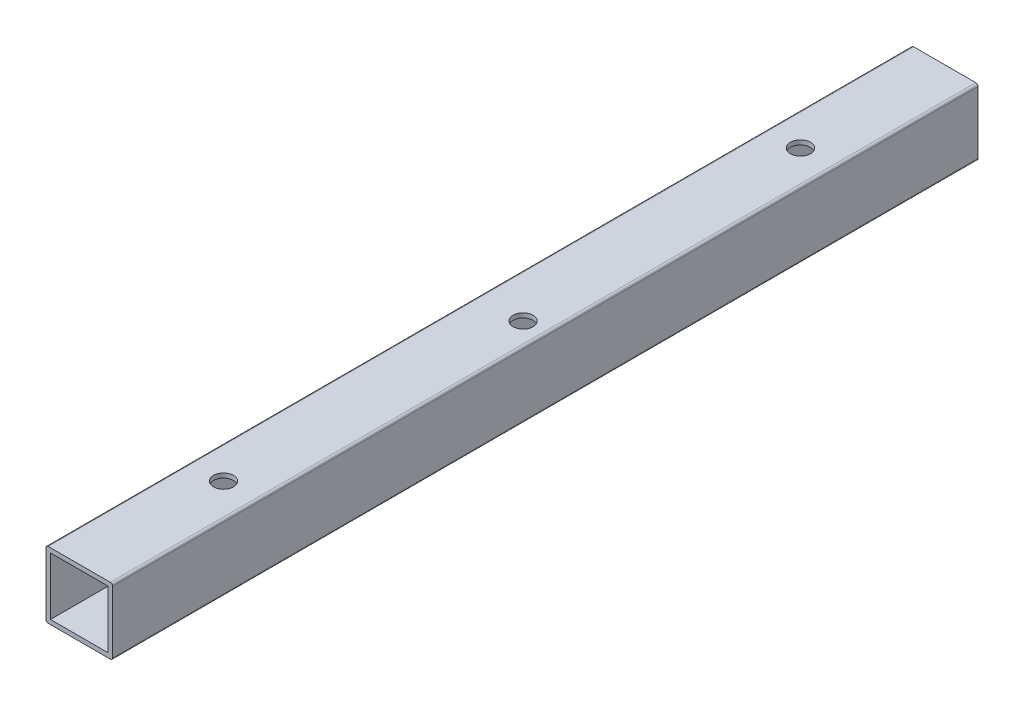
ISO-10303-21;
HEADER;
FILE_DESCRIPTION(('STEP AP214'),'2;1');
FILE_NAME('part.step','',(''),(''),'','','');
FILE_SCHEMA(('AUTOMOTIVE_DESIGN { 1 0 10303 214 1 1 1 1 }'));
ENDSEC;
DATA;
#1=APPLICATION_CONTEXT('core data for automotive mechanical design processes');
#2=APPLICATION_PROTOCOL_DEFINITION('international standard','automotive_design',2000,#1);
#3=PRODUCT_CONTEXT('',#1,'mechanical');
#4=PRODUCT('Part','Part','',(#3));
#5=PRODUCT_RELATED_PRODUCT_CATEGORY('part','',(#4));
#6=PRODUCT_DEFINITION_FORMATION('','',#4);
#7=PRODUCT_DEFINITION_CONTEXT('part definition',#1,'design');
#8=PRODUCT_DEFINITION('design','',#6,#7);
#9=PRODUCT_DEFINITION_SHAPE('','',#8);
#10=(LENGTH_UNIT() NAMED_UNIT(*) SI_UNIT(.MILLI.,.METRE.));
#11=(NAMED_UNIT(*) PLANE_ANGLE_UNIT() SI_UNIT($,.RADIAN.));
#12=(NAMED_UNIT(*) SI_UNIT($,.STERADIAN.) SOLID_ANGLE_UNIT());
#13=UNCERTAINTY_MEASURE_WITH_UNIT(LENGTH_MEASURE(1.E-05),#10,'distance_accuracy_value','');
#14=(GEOMETRIC_REPRESENTATION_CONTEXT(3) GLOBAL_UNCERTAINTY_ASSIGNED_CONTEXT((#13)) GLOBAL_UNIT_ASSIGNED_CONTEXT((#10,
#11,#12)) REPRESENTATION_CONTEXT('',''));
#15=CARTESIAN_POINT('',(0.,0.,0.));
#16=DIRECTION('',(0.,0.,1.));
#17=DIRECTION('',(1.,0.,0.));
#18=AXIS2_PLACEMENT_3D('',#15,#16,#17);
#19=CARTESIAN_POINT('',(-14.,-14.,0.));
#20=DIRECTION('',(0.,0.,-1.));
#21=DIRECTION('',(-1.,0.,0.));
#22=AXIS2_PLACEMENT_3D('',#19,#20,#21);
#23=PLANE('',#22);
#24=CARTESIAN_POINT('',(-14.,-14.,0.));
#25=DIRECTION('',(0.,0.,-1.));
#26=DIRECTION('',(-1.,0.,0.));
#27=AXIS2_PLACEMENT_3D('',#24,#25,#26);
#28=CIRCLE('',#27,0.999999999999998);
#29=CARTESIAN_POINT('',(-14.,-15.,0.));
#30=VERTEX_POINT('',#29);
#31=CARTESIAN_POINT('',(-15.,-14.,0.));
#32=VERTEX_POINT('',#31);
#33=EDGE_CURVE('E127',#30,#32,#28,.T.);
#34=ORIENTED_EDGE('',*,*,#33,.T.);
#35=DIRECTION('',(0.,-1.,0.));
#36=VECTOR('',#35,1.);
#37=CARTESIAN_POINT('',(-15.,14.,0.));
#38=LINE('',#37,#36);
#39=CARTESIAN_POINT('',(-15.,14.,0.));
#40=VERTEX_POINT('',#39);
#41=EDGE_CURVE('E163',#40,#32,#38,.T.);
#42=ORIENTED_EDGE('',*,*,#41,.F.);
#43=CARTESIAN_POINT('',(-14.,14.,0.));
#44=DIRECTION('',(0.,0.,-1.));
#45=DIRECTION('',(-1.,0.,0.));
#46=AXIS2_PLACEMENT_3D('',#43,#44,#45);
#47=CIRCLE('',#46,0.999999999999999);
#48=CARTESIAN_POINT('',(-14.,15.,0.));
#49=VERTEX_POINT('',#48);
#50=EDGE_CURVE('E166',#40,#49,#47,.T.);
#51=ORIENTED_EDGE('',*,*,#50,.T.);
#52=DIRECTION('',(1.,0.,0.));
#53=VECTOR('',#52,1.);
#54=CARTESIAN_POINT('',(-14.,15.,0.));
#55=LINE('',#54,#53);
#56=CARTESIAN_POINT('',(14.,15.,0.));
#57=VERTEX_POINT('',#56);
#58=EDGE_CURVE('E169',#49,#57,#55,.T.);
#59=ORIENTED_EDGE('',*,*,#58,.T.);
#60=CARTESIAN_POINT('',(14.,14.,0.));
#61=DIRECTION('',(0.,0.,1.));
#62=DIRECTION('',(1.,0.,0.));
#63=AXIS2_PLACEMENT_3D('',#60,#61,#62);
#64=CIRCLE('',#63,0.999999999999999);
#65=CARTESIAN_POINT('',(15.,14.,0.));
#66=VERTEX_POINT('',#65);
#67=EDGE_CURVE('E172',#66,#57,#64,.T.);
#68=ORIENTED_EDGE('',*,*,#67,.F.);
#69=DIRECTION('',(0.,1.,0.));
#70=VECTOR('',#69,1.);
#71=CARTESIAN_POINT('',(15.,-14.,0.));
#72=LINE('',#71,#70);
#73=CARTESIAN_POINT('',(15.,-14.,0.));
#74=VERTEX_POINT('',#73);
#75=EDGE_CURVE('E175',#74,#66,#72,.T.);
#76=ORIENTED_EDGE('',*,*,#75,.F.);
#77=CARTESIAN_POINT('',(14.,-14.,0.));
#78=DIRECTION('',(0.,0.,-1.));
#79=DIRECTION('',(-1.,0.,0.));
#80=AXIS2_PLACEMENT_3D('',#77,#78,#79);
#81=CIRCLE('',#80,1.);
#82=CARTESIAN_POINT('',(14.,-15.,0.));
#83=VERTEX_POINT('',#82);
#84=EDGE_CURVE('E177',#74,#83,#81,.T.);
#85=ORIENTED_EDGE('',*,*,#84,.T.);
#86=DIRECTION('',(-1.,0.,0.));
#87=VECTOR('',#86,1.);
#88=CARTESIAN_POINT('',(14.,-15.,0.));
#89=LINE('',#88,#87);
#90=EDGE_CURVE('E180',#83,#30,#89,.T.);
#91=ORIENTED_EDGE('',*,*,#90,.T.);
#92=EDGE_LOOP('',(#34,#42,#51,#59,#68,#76,#85,#91));
#93=FACE_BOUND('',#92,.T.);
#94=DIRECTION('',(1.,0.,0.));
#95=VECTOR('',#94,1.);
#96=CARTESIAN_POINT('',(-14.,13.,0.));
#97=LINE('',#96,#95);
#98=CARTESIAN_POINT('',(-13.,13.,0.));
#99=VERTEX_POINT('',#98);
#100=CARTESIAN_POINT('',(13.,13.,0.));
#101=VERTEX_POINT('',#100);
#102=EDGE_CURVE('E139',#99,#101,#97,.T.);
#103=ORIENTED_EDGE('',*,*,#102,.F.);
#104=DIRECTION('',(0.,-1.,0.));
#105=VECTOR('',#104,1.);
#106=CARTESIAN_POINT('',(-13.,-14.,0.));
#107=LINE('',#106,#105);
#108=CARTESIAN_POINT('',(-13.,-13.,0.));
#109=VERTEX_POINT('',#108);
#110=EDGE_CURVE('E55',#99,#109,#107,.T.);
#111=ORIENTED_EDGE('',*,*,#110,.T.);
#112=DIRECTION('',(-1.,0.,0.));
#113=VECTOR('',#112,1.);
#114=CARTESIAN_POINT('',(-14.,-13.,0.));
#115=LINE('',#114,#113);
#116=CARTESIAN_POINT('',(13.,-13.,0.));
#117=VERTEX_POINT('',#116);
#118=EDGE_CURVE('E131',#117,#109,#115,.T.);
#119=ORIENTED_EDGE('',*,*,#118,.F.);
#120=DIRECTION('',(0.,1.,0.));
#121=VECTOR('',#120,1.);
#122=CARTESIAN_POINT('',(13.,-14.,0.));
#123=LINE('',#122,#121);
#124=EDGE_CURVE('E136',#117,#101,#123,.T.);
#125=ORIENTED_EDGE('',*,*,#124,.T.);
#126=EDGE_LOOP('',(#103,#111,#119,#125));
#127=FACE_BOUND('',#126,.T.);
#128=ADVANCED_FACE('F30',(#93,#127),#23,.T.);
#129=CARTESIAN_POINT('',(-14.,-14.,390.));
#130=DIRECTION('',(0.,0.,-1.));
#131=DIRECTION('',(-1.,0.,0.));
#132=AXIS2_PLACEMENT_3D('',#129,#130,#131);
#133=CYLINDRICAL_SURFACE('',#132,0.999999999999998);
#134=ORIENTED_EDGE('',*,*,#33,.F.);
#135=DIRECTION('',(0.,0.,-1.));
#136=VECTOR('',#135,1.);
#137=CARTESIAN_POINT('',(-14.,-15.,390.));
#138=LINE('',#137,#136);
#139=CARTESIAN_POINT('',(-14.,-15.,390.));
#140=VERTEX_POINT('',#139);
#141=EDGE_CURVE('E11',#140,#30,#138,.T.);
#142=ORIENTED_EDGE('',*,*,#141,.F.);
#143=CARTESIAN_POINT('',(-14.,-14.,390.));
#144=DIRECTION('',(0.,0.,-1.));
#145=DIRECTION('',(-1.,0.,0.));
#146=AXIS2_PLACEMENT_3D('',#143,#144,#145);
#147=CIRCLE('',#146,0.999999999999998);
#148=CARTESIAN_POINT('',(-15.,-14.,390.));
#149=VERTEX_POINT('',#148);
#150=EDGE_CURVE('E183',#140,#149,#147,.T.);
#151=ORIENTED_EDGE('',*,*,#150,.T.);
#152=DIRECTION('',(0.,0.,-1.));
#153=VECTOR('',#152,1.);
#154=CARTESIAN_POINT('',(-15.,-14.,390.));
#155=LINE('',#154,#153);
#156=EDGE_CURVE('E203',#149,#32,#155,.T.);
#157=ORIENTED_EDGE('',*,*,#156,.T.);
#158=EDGE_LOOP('',(#134,#142,#151,#157));
#159=FACE_BOUND('',#158,.T.);
#160=ADVANCED_FACE('F32',(#159),#133,.T.);
#161=CARTESIAN_POINT('',(14.,-15.,390.));
#162=DIRECTION('',(0.,-1.,0.));
#163=DIRECTION('',(1.,0.,0.));
#164=AXIS2_PLACEMENT_3D('',#161,#162,#163);
#165=PLANE('',#164);
#166=CARTESIAN_POINT('',(5.,-15.,195.));
#167=DIRECTION('',(0.,-1.,0.));
#168=DIRECTION('',(1.,0.,0.));
#169=AXIS2_PLACEMENT_3D('',#166,#167,#168);
#170=CIRCLE('',#169,4.5);
#171=CARTESIAN_POINT('',(9.50000000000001,-15.,195.));
#172=VERTEX_POINT('',#171);
#173=EDGE_CURVE('E407',#172,#172,#170,.T.);
#174=ORIENTED_EDGE('',*,*,#173,.F.);
#175=EDGE_LOOP('',(#174));
#176=FACE_BOUND('',#175,.T.);
#177=CARTESIAN_POINT('',(0.,-15.,65.));
#178=DIRECTION('',(0.,-1.,0.));
#179=DIRECTION('',(1.,0.,0.));
#180=AXIS2_PLACEMENT_3D('',#177,#178,#179);
#181=CIRCLE('',#180,4.5);
#182=CARTESIAN_POINT('',(4.5,-15.,65.));
#183=VERTEX_POINT('',#182);
#184=EDGE_CURVE('E224',#183,#183,#181,.T.);
#185=ORIENTED_EDGE('',*,*,#184,.F.);
#186=EDGE_LOOP('',(#185));
#187=FACE_BOUND('',#186,.T.);
#188=CARTESIAN_POINT('',(0.,-15.,325.));
#189=DIRECTION('',(0.,-1.,0.));
#190=DIRECTION('',(1.,0.,0.));
#191=AXIS2_PLACEMENT_3D('',#188,#189,#190);
#192=CIRCLE('',#191,4.5);
#193=CARTESIAN_POINT('',(4.5,-15.,325.));
#194=VERTEX_POINT('',#193);
#195=EDGE_CURVE('E220',#194,#194,#192,.T.);
#196=ORIENTED_EDGE('',*,*,#195,.F.);
#197=EDGE_LOOP('',(#196));
#198=FACE_BOUND('',#197,.T.);
#199=ORIENTED_EDGE('',*,*,#90,.F.);
#200=DIRECTION('',(0.,0.,-1.));
#201=VECTOR('',#200,1.);
#202=CARTESIAN_POINT('',(14.,-15.,390.));
#203=LINE('',#202,#201);
#204=CARTESIAN_POINT('',(14.,-15.,390.));
#205=VERTEX_POINT('',#204);
#206=EDGE_CURVE('E39',#205,#83,#203,.T.);
#207=ORIENTED_EDGE('',*,*,#206,.F.);
#208=DIRECTION('',(-1.,0.,0.));
#209=VECTOR('',#208,1.);
#210=CARTESIAN_POINT('',(14.,-15.,390.));
#211=LINE('',#210,#209);
#212=EDGE_CURVE('E201',#205,#140,#211,.T.);
#213=ORIENTED_EDGE('',*,*,#212,.T.);
#214=ORIENTED_EDGE('',*,*,#141,.T.);
#215=EDGE_LOOP('',(#199,#207,#213,#214));
#216=FACE_BOUND('',#215,.T.);
#217=ADVANCED_FACE('F269',(#176,#187,#198,#216),#165,.T.);
#218=CARTESIAN_POINT('',(14.,-14.,390.));
#219=DIRECTION('',(0.,0.,-1.));
#220=DIRECTION('',(-1.,0.,0.));
#221=AXIS2_PLACEMENT_3D('',#218,#219,#220);
#222=CYLINDRICAL_SURFACE('',#221,1.);
#223=ORIENTED_EDGE('',*,*,#84,.F.);
#224=DIRECTION('',(0.,0.,-1.));
#225=VECTOR('',#224,1.);
#226=CARTESIAN_POINT('',(15.,-14.,390.));
#227=LINE('',#226,#225);
#228=CARTESIAN_POINT('',(15.,-14.,390.));
#229=VERTEX_POINT('',#228);
#230=EDGE_CURVE('E206',#229,#74,#227,.T.);
#231=ORIENTED_EDGE('',*,*,#230,.F.);
#232=CARTESIAN_POINT('',(14.,-14.,390.));
#233=DIRECTION('',(0.,0.,-1.));
#234=DIRECTION('',(-1.,0.,0.));
#235=AXIS2_PLACEMENT_3D('',#232,#233,#234);
#236=CIRCLE('',#235,1.);
#237=EDGE_CURVE('E198',#229,#205,#236,.T.);
#238=ORIENTED_EDGE('',*,*,#237,.T.);
#239=ORIENTED_EDGE('',*,*,#206,.T.);
#240=EDGE_LOOP('',(#223,#231,#238,#239));
#241=FACE_BOUND('',#240,.T.);
#242=ADVANCED_FACE('F281',(#241),#222,.T.);
#243=CARTESIAN_POINT('',(15.,-14.,390.));
#244=DIRECTION('',(-1.,0.,0.));
#245=DIRECTION('',(0.,-1.,0.));
#246=AXIS2_PLACEMENT_3D('',#243,#244,#245);
#247=PLANE('',#246);
#248=ORIENTED_EDGE('',*,*,#75,.T.);
#249=DIRECTION('',(0.,0.,-1.));
#250=VECTOR('',#249,1.);
#251=CARTESIAN_POINT('',(15.,14.,390.));
#252=LINE('',#251,#250);
#253=CARTESIAN_POINT('',(15.,14.,390.));
#254=VERTEX_POINT('',#253);
#255=EDGE_CURVE('E208',#254,#66,#252,.T.);
#256=ORIENTED_EDGE('',*,*,#255,.F.);
#257=DIRECTION('',(0.,1.,0.));
#258=VECTOR('',#257,1.);
#259=CARTESIAN_POINT('',(15.,-14.,390.));
#260=LINE('',#259,#258);
#261=EDGE_CURVE('E196',#229,#254,#260,.T.);
#262=ORIENTED_EDGE('',*,*,#261,.F.);
#263=ORIENTED_EDGE('',*,*,#230,.T.);
#264=EDGE_LOOP('',(#248,#256,#262,#263));
#265=FACE_BOUND('',#264,.T.);
#266=ADVANCED_FACE('F285',(#265),#247,.F.);
#267=CARTESIAN_POINT('',(14.,14.,390.));
#268=DIRECTION('',(0.,0.,-1.));
#269=DIRECTION('',(-1.,0.,0.));
#270=AXIS2_PLACEMENT_3D('',#267,#268,#269);
#271=CYLINDRICAL_SURFACE('',#270,0.999999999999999);
#272=ORIENTED_EDGE('',*,*,#67,.T.);
#273=DIRECTION('',(0.,0.,-1.));
#274=VECTOR('',#273,1.);
#275=CARTESIAN_POINT('',(14.,15.,390.));
#276=LINE('',#275,#274);
#277=CARTESIAN_POINT('',(14.,15.,390.));
#278=VERTEX_POINT('',#277);
#279=EDGE_CURVE('E211',#278,#57,#276,.T.);
#280=ORIENTED_EDGE('',*,*,#279,.F.);
#281=CARTESIAN_POINT('',(14.,14.,390.));
#282=DIRECTION('',(0.,0.,1.));
#283=DIRECTION('',(1.,0.,0.));
#284=AXIS2_PLACEMENT_3D('',#281,#282,#283);
#285=CIRCLE('',#284,0.999999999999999);
#286=EDGE_CURVE('E194',#254,#278,#285,.T.);
#287=ORIENTED_EDGE('',*,*,#286,.F.);
#288=ORIENTED_EDGE('',*,*,#255,.T.);
#289=EDGE_LOOP('',(#272,#280,#287,#288));
#290=FACE_BOUND('',#289,.T.);
#291=ADVANCED_FACE('F289',(#290),#271,.T.);
#292=CARTESIAN_POINT('',(-14.,15.,390.));
#293=DIRECTION('',(0.,1.,0.));
#294=DIRECTION('',(0.,0.,1.));
#295=AXIS2_PLACEMENT_3D('',#292,#293,#294);
#296=PLANE('',#295);
#297=CARTESIAN_POINT('',(5.,15.,195.));
#298=DIRECTION('',(0.,1.,0.));
#299=DIRECTION('',(0.,0.,1.));
#300=AXIS2_PLACEMENT_3D('',#297,#298,#299);
#301=CIRCLE('',#300,4.5);
#302=CARTESIAN_POINT('',(5.,15.,199.5));
#303=VERTEX_POINT('',#302);
#304=EDGE_CURVE('E231',#303,#303,#301,.T.);
#305=ORIENTED_EDGE('',*,*,#304,.F.);
#306=EDGE_LOOP('',(#305));
#307=FACE_BOUND('',#306,.T.);
#308=CARTESIAN_POINT('',(0.,15.,65.));
#309=DIRECTION('',(0.,1.,0.));
#310=DIRECTION('',(0.,0.,1.));
#311=AXIS2_PLACEMENT_3D('',#308,#309,#310);
#312=CIRCLE('',#311,4.5);
#313=CARTESIAN_POINT('',(0.,15.,69.5));
#314=VERTEX_POINT('',#313);
#315=EDGE_CURVE('E228',#314,#314,#312,.T.);
#316=ORIENTED_EDGE('',*,*,#315,.F.);
#317=EDGE_LOOP('',(#316));
#318=FACE_BOUND('',#317,.T.);
#319=CARTESIAN_POINT('',(0.,15.,325.));
#320=DIRECTION('',(0.,1.,0.));
#321=DIRECTION('',(0.,0.,1.));
#322=AXIS2_PLACEMENT_3D('',#319,#320,#321);
#323=CIRCLE('',#322,4.5);
#324=CARTESIAN_POINT('',(0.,15.,329.5));
#325=VERTEX_POINT('',#324);
#326=EDGE_CURVE('E140',#325,#325,#323,.T.);
#327=ORIENTED_EDGE('',*,*,#326,.F.);
#328=EDGE_LOOP('',(#327));
#329=FACE_BOUND('',#328,.T.);
#330=ORIENTED_EDGE('',*,*,#58,.F.);
#331=DIRECTION('',(0.,0.,-1.));
#332=VECTOR('',#331,1.);
#333=CARTESIAN_POINT('',(-14.,15.,390.));
#334=LINE('',#333,#332);
#335=CARTESIAN_POINT('',(-14.,15.,390.));
#336=VERTEX_POINT('',#335);
#337=EDGE_CURVE('E213',#336,#49,#334,.T.);
#338=ORIENTED_EDGE('',*,*,#337,.F.);
#339=DIRECTION('',(1.,0.,0.));
#340=VECTOR('',#339,1.);
#341=CARTESIAN_POINT('',(-14.,15.,390.));
#342=LINE('',#341,#340);
#343=EDGE_CURVE('E191',#336,#278,#342,.T.);
#344=ORIENTED_EDGE('',*,*,#343,.T.);
#345=ORIENTED_EDGE('',*,*,#279,.T.);
#346=EDGE_LOOP('',(#330,#338,#344,#345));
#347=FACE_BOUND('',#346,.T.);
#348=ADVANCED_FACE('F293',(#307,#318,#329,#347),#296,.T.);
#349=CARTESIAN_POINT('',(-14.,14.,390.));
#350=DIRECTION('',(0.,0.,-1.));
#351=DIRECTION('',(-1.,0.,0.));
#352=AXIS2_PLACEMENT_3D('',#349,#350,#351);
#353=CYLINDRICAL_SURFACE('',#352,0.999999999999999);
#354=ORIENTED_EDGE('',*,*,#50,.F.);
#355=DIRECTION('',(0.,0.,-1.));
#356=VECTOR('',#355,1.);
#357=CARTESIAN_POINT('',(-15.,14.,390.));
#358=LINE('',#357,#356);
#359=CARTESIAN_POINT('',(-15.,14.,390.));
#360=VERTEX_POINT('',#359);
#361=EDGE_CURVE('E215',#360,#40,#358,.T.);
#362=ORIENTED_EDGE('',*,*,#361,.F.);
#363=CARTESIAN_POINT('',(-14.,14.,390.));
#364=DIRECTION('',(0.,0.,-1.));
#365=DIRECTION('',(-1.,0.,0.));
#366=AXIS2_PLACEMENT_3D('',#363,#364,#365);
#367=CIRCLE('',#366,0.999999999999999);
#368=EDGE_CURVE('E188',#360,#336,#367,.T.);
#369=ORIENTED_EDGE('',*,*,#368,.T.);
#370=ORIENTED_EDGE('',*,*,#337,.T.);
#371=EDGE_LOOP('',(#354,#362,#369,#370));
#372=FACE_BOUND('',#371,.T.);
#373=ADVANCED_FACE('F297',(#372),#353,.T.);
#374=CARTESIAN_POINT('',(-15.,14.,390.));
#375=DIRECTION('',(1.,0.,0.));
#376=DIRECTION('',(0.,1.,0.));
#377=AXIS2_PLACEMENT_3D('',#374,#375,#376);
#378=PLANE('',#377);
#379=ORIENTED_EDGE('',*,*,#41,.T.);
#380=ORIENTED_EDGE('',*,*,#156,.F.);
#381=DIRECTION('',(0.,-1.,0.));
#382=VECTOR('',#381,1.);
#383=CARTESIAN_POINT('',(-15.,14.,390.));
#384=LINE('',#383,#382);
#385=EDGE_CURVE('E186',#360,#149,#384,.T.);
#386=ORIENTED_EDGE('',*,*,#385,.F.);
#387=ORIENTED_EDGE('',*,*,#361,.T.);
#388=EDGE_LOOP('',(#379,#380,#386,#387));
#389=FACE_BOUND('',#388,.T.);
#390=ADVANCED_FACE('F277',(#389),#378,.F.);
#391=CARTESIAN_POINT('',(-14.,-14.,390.));
#392=DIRECTION('',(0.,0.,-1.));
#393=DIRECTION('',(-1.,0.,0.));
#394=AXIS2_PLACEMENT_3D('',#391,#392,#393);
#395=PLANE('',#394);
#396=DIRECTION('',(0.,1.,0.));
#397=VECTOR('',#396,1.);
#398=CARTESIAN_POINT('',(13.,-14.,390.));
#399=LINE('',#398,#397);
#400=CARTESIAN_POINT('',(13.,-13.,390.));
#401=VERTEX_POINT('',#400);
#402=CARTESIAN_POINT('',(13.,13.,390.));
#403=VERTEX_POINT('',#402);
#404=EDGE_CURVE('E152',#401,#403,#399,.T.);
#405=ORIENTED_EDGE('',*,*,#404,.F.);
#406=DIRECTION('',(-1.,0.,0.));
#407=VECTOR('',#406,1.);
#408=CARTESIAN_POINT('',(-14.,-13.,390.));
#409=LINE('',#408,#407);
#410=CARTESIAN_POINT('',(-13.,-13.,390.));
#411=VERTEX_POINT('',#410);
#412=EDGE_CURVE('E150',#401,#411,#409,.T.);
#413=ORIENTED_EDGE('',*,*,#412,.T.);
#414=DIRECTION('',(0.,-1.,0.));
#415=VECTOR('',#414,1.);
#416=CARTESIAN_POINT('',(-13.,-14.,390.));
#417=LINE('',#416,#415);
#418=CARTESIAN_POINT('',(-13.,13.,390.));
#419=VERTEX_POINT('',#418);
#420=EDGE_CURVE('E123',#419,#411,#417,.T.);
#421=ORIENTED_EDGE('',*,*,#420,.F.);
#422=DIRECTION('',(1.,0.,0.));
#423=VECTOR('',#422,1.);
#424=CARTESIAN_POINT('',(-14.,13.,390.));
#425=LINE('',#424,#423);
#426=EDGE_CURVE('E154',#419,#403,#425,.T.);
#427=ORIENTED_EDGE('',*,*,#426,.T.);
#428=EDGE_LOOP('',(#405,#413,#421,#427));
#429=FACE_BOUND('',#428,.T.);
#430=ORIENTED_EDGE('',*,*,#150,.F.);
#431=ORIENTED_EDGE('',*,*,#212,.F.);
#432=ORIENTED_EDGE('',*,*,#237,.F.);
#433=ORIENTED_EDGE('',*,*,#261,.T.);
#434=ORIENTED_EDGE('',*,*,#286,.T.);
#435=ORIENTED_EDGE('',*,*,#343,.F.);
#436=ORIENTED_EDGE('',*,*,#368,.F.);
#437=ORIENTED_EDGE('',*,*,#385,.T.);
#438=EDGE_LOOP('',(#430,#431,#432,#433,#434,#435,#436,#437));
#439=FACE_BOUND('',#438,.T.);
#440=ADVANCED_FACE('F274',(#429,#439),#395,.F.);
#441=CARTESIAN_POINT('',(-13.,-14.,390.));
#442=DIRECTION('',(1.,0.,0.));
#443=DIRECTION('',(0.,1.,0.));
#444=AXIS2_PLACEMENT_3D('',#441,#442,#443);
#445=PLANE('',#444);
#446=ORIENTED_EDGE('',*,*,#110,.F.);
#447=DIRECTION('',(0.,0.,-1.));
#448=VECTOR('',#447,1.);
#449=CARTESIAN_POINT('',(-13.,13.,390.));
#450=LINE('',#449,#448);
#451=EDGE_CURVE('E157',#419,#99,#450,.T.);
#452=ORIENTED_EDGE('',*,*,#451,.F.);
#453=ORIENTED_EDGE('',*,*,#420,.T.);
#454=DIRECTION('',(0.,0.,-1.));
#455=VECTOR('',#454,1.);
#456=CARTESIAN_POINT('',(-13.,-13.,390.));
#457=LINE('',#456,#455);
#458=EDGE_CURVE('E119',#411,#109,#457,.T.);
#459=ORIENTED_EDGE('',*,*,#458,.T.);
#460=EDGE_LOOP('',(#446,#452,#453,#459));
#461=FACE_BOUND('',#460,.T.);
#462=ADVANCED_FACE('F121',(#461),#445,.T.);
#463=CARTESIAN_POINT('',(-14.,-13.,390.));
#464=DIRECTION('',(0.,-1.,0.));
#465=DIRECTION('',(1.,0.,0.));
#466=AXIS2_PLACEMENT_3D('',#463,#464,#465);
#467=PLANE('',#466);
#468=CARTESIAN_POINT('',(5.,-13.,195.));
#469=DIRECTION('',(0.,-1.,0.));
#470=DIRECTION('',(1.,0.,0.));
#471=AXIS2_PLACEMENT_3D('',#468,#469,#470);
#472=CIRCLE('',#471,4.5);
#473=CARTESIAN_POINT('',(9.50000000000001,-13.,195.));
#474=VERTEX_POINT('',#473);
#475=EDGE_CURVE('E236',#474,#474,#472,.T.);
#476=ORIENTED_EDGE('',*,*,#475,.T.);
#477=EDGE_LOOP('',(#476));
#478=FACE_BOUND('',#477,.T.);
#479=CARTESIAN_POINT('',(0.,-13.,65.));
#480=DIRECTION('',(0.,-1.,0.));
#481=DIRECTION('',(1.,0.,0.));
#482=AXIS2_PLACEMENT_3D('',#479,#480,#481);
#483=CIRCLE('',#482,4.5);
#484=CARTESIAN_POINT('',(4.5,-13.,65.));
#485=VERTEX_POINT('',#484);
#486=EDGE_CURVE('E223',#485,#485,#483,.T.);
#487=ORIENTED_EDGE('',*,*,#486,.T.);
#488=EDGE_LOOP('',(#487));
#489=FACE_BOUND('',#488,.T.);
#490=CARTESIAN_POINT('',(0.,-13.,325.));
#491=DIRECTION('',(0.,-1.,0.));
#492=DIRECTION('',(1.,0.,0.));
#493=AXIS2_PLACEMENT_3D('',#490,#491,#492);
#494=CIRCLE('',#493,4.5);
#495=CARTESIAN_POINT('',(4.5,-13.,325.));
#496=VERTEX_POINT('',#495);
#497=EDGE_CURVE('E143',#496,#496,#494,.T.);
#498=ORIENTED_EDGE('',*,*,#497,.T.);
#499=EDGE_LOOP('',(#498));
#500=FACE_BOUND('',#499,.T.);
#501=ORIENTED_EDGE('',*,*,#118,.T.);
#502=ORIENTED_EDGE('',*,*,#458,.F.);
#503=ORIENTED_EDGE('',*,*,#412,.F.);
#504=DIRECTION('',(0.,0.,-1.));
#505=VECTOR('',#504,1.);
#506=CARTESIAN_POINT('',(13.,-13.,390.));
#507=LINE('',#506,#505);
#508=EDGE_CURVE('E128',#401,#117,#507,.T.);
#509=ORIENTED_EDGE('',*,*,#508,.T.);
#510=EDGE_LOOP('',(#501,#502,#503,#509));
#511=FACE_BOUND('',#510,.T.);
#512=ADVANCED_FACE('F132',(#478,#489,#500,#511),#467,.F.);
#513=CARTESIAN_POINT('',(13.,-14.,390.));
#514=DIRECTION('',(-1.,0.,0.));
#515=DIRECTION('',(0.,-1.,0.));
#516=AXIS2_PLACEMENT_3D('',#513,#514,#515);
#517=PLANE('',#516);
#518=ORIENTED_EDGE('',*,*,#124,.F.);
#519=ORIENTED_EDGE('',*,*,#508,.F.);
#520=ORIENTED_EDGE('',*,*,#404,.T.);
#521=DIRECTION('',(0.,0.,-1.));
#522=VECTOR('',#521,1.);
#523=CARTESIAN_POINT('',(13.,13.,390.));
#524=LINE('',#523,#522);
#525=EDGE_CURVE('E47',#403,#101,#524,.T.);
#526=ORIENTED_EDGE('',*,*,#525,.T.);
#527=EDGE_LOOP('',(#518,#519,#520,#526));
#528=FACE_BOUND('',#527,.T.);
#529=ADVANCED_FACE('F345',(#528),#517,.T.);
#530=CARTESIAN_POINT('',(-14.,13.,390.));
#531=DIRECTION('',(0.,1.,0.));
#532=DIRECTION('',(0.,0.,1.));
#533=AXIS2_PLACEMENT_3D('',#530,#531,#532);
#534=PLANE('',#533);
#535=CARTESIAN_POINT('',(5.,13.,195.));
#536=DIRECTION('',(0.,1.,0.));
#537=DIRECTION('',(0.,0.,1.));
#538=AXIS2_PLACEMENT_3D('',#535,#536,#537);
#539=CIRCLE('',#538,4.5);
#540=CARTESIAN_POINT('',(5.,13.,199.5));
#541=VERTEX_POINT('',#540);
#542=EDGE_CURVE('E34',#541,#541,#539,.T.);
#543=ORIENTED_EDGE('',*,*,#542,.T.);
#544=EDGE_LOOP('',(#543));
#545=FACE_BOUND('',#544,.T.);
#546=CARTESIAN_POINT('',(0.,13.,65.));
#547=DIRECTION('',(0.,1.,0.));
#548=DIRECTION('',(0.,0.,1.));
#549=AXIS2_PLACEMENT_3D('',#546,#547,#548);
#550=CIRCLE('',#549,4.5);
#551=CARTESIAN_POINT('',(0.,13.,69.5));
#552=VERTEX_POINT('',#551);
#553=EDGE_CURVE('E221',#552,#552,#550,.T.);
#554=ORIENTED_EDGE('',*,*,#553,.T.);
#555=EDGE_LOOP('',(#554));
#556=FACE_BOUND('',#555,.T.);
#557=CARTESIAN_POINT('',(0.,13.,325.));
#558=DIRECTION('',(0.,1.,0.));
#559=DIRECTION('',(0.,0.,1.));
#560=AXIS2_PLACEMENT_3D('',#557,#558,#559);
#561=CIRCLE('',#560,4.5);
#562=CARTESIAN_POINT('',(0.,13.,329.5));
#563=VERTEX_POINT('',#562);
#564=EDGE_CURVE('E218',#563,#563,#561,.T.);
#565=ORIENTED_EDGE('',*,*,#564,.T.);
#566=EDGE_LOOP('',(#565));
#567=FACE_BOUND('',#566,.T.);
#568=ORIENTED_EDGE('',*,*,#102,.T.);
#569=ORIENTED_EDGE('',*,*,#525,.F.);
#570=ORIENTED_EDGE('',*,*,#426,.F.);
#571=ORIENTED_EDGE('',*,*,#451,.T.);
#572=EDGE_LOOP('',(#568,#569,#570,#571));
#573=FACE_BOUND('',#572,.T.);
#574=ADVANCED_FACE('F260',(#545,#556,#567,#573),#534,.F.);
#575=CARTESIAN_POINT('',(0.,20.,325.));
#576=DIRECTION('',(0.,-1.,0.));
#577=DIRECTION('',(1.,0.,0.));
#578=AXIS2_PLACEMENT_3D('',#575,#576,#577);
#579=CYLINDRICAL_SURFACE('',#578,4.5);
#580=ORIENTED_EDGE('',*,*,#326,.T.);
#581=EDGE_LOOP('',(#580));
#582=FACE_BOUND('',#581,.T.);
#583=ORIENTED_EDGE('',*,*,#564,.F.);
#584=EDGE_LOOP('',(#583));
#585=FACE_BOUND('',#584,.T.);
#586=ADVANCED_FACE('F250',(#582,#585),#579,.F.);
#587=ORIENTED_EDGE('',*,*,#195,.T.);
#588=EDGE_LOOP('',(#587));
#589=FACE_BOUND('',#588,.T.);
#590=ORIENTED_EDGE('',*,*,#497,.F.);
#591=EDGE_LOOP('',(#590));
#592=FACE_BOUND('',#591,.T.);
#593=ADVANCED_FACE('F247',(#589,#592),#579,.F.);
#594=CARTESIAN_POINT('',(0.,20.,65.));
#595=DIRECTION('',(0.,-1.,0.));
#596=DIRECTION('',(1.,0.,0.));
#597=AXIS2_PLACEMENT_3D('',#594,#595,#596);
#598=CYLINDRICAL_SURFACE('',#597,4.5);
#599=ORIENTED_EDGE('',*,*,#315,.T.);
#600=EDGE_LOOP('',(#599));
#601=FACE_BOUND('',#600,.T.);
#602=ORIENTED_EDGE('',*,*,#553,.F.);
#603=EDGE_LOOP('',(#602));
#604=FACE_BOUND('',#603,.T.);
#605=ADVANCED_FACE('F249',(#601,#604),#598,.F.);
#606=ORIENTED_EDGE('',*,*,#184,.T.);
#607=EDGE_LOOP('',(#606));
#608=FACE_BOUND('',#607,.T.);
#609=ORIENTED_EDGE('',*,*,#486,.F.);
#610=EDGE_LOOP('',(#609));
#611=FACE_BOUND('',#610,.T.);
#612=ADVANCED_FACE('F257',(#608,#611),#598,.F.);
#613=CARTESIAN_POINT('',(5.,20.,195.));
#614=DIRECTION('',(0.,-1.,0.));
#615=DIRECTION('',(1.,0.,0.));
#616=AXIS2_PLACEMENT_3D('',#613,#614,#615);
#617=CYLINDRICAL_SURFACE('',#616,4.5);
#618=ORIENTED_EDGE('',*,*,#304,.T.);
#619=EDGE_LOOP('',(#618));
#620=FACE_BOUND('',#619,.T.);
#621=ORIENTED_EDGE('',*,*,#542,.F.);
#622=EDGE_LOOP('',(#621));
#623=FACE_BOUND('',#622,.T.);
#624=ADVANCED_FACE('F383',(#620,#623),#617,.F.);
#625=ORIENTED_EDGE('',*,*,#173,.T.);
#626=EDGE_LOOP('',(#625));
#627=FACE_BOUND('',#626,.T.);
#628=ORIENTED_EDGE('',*,*,#475,.F.);
#629=EDGE_LOOP('',(#628));
#630=FACE_BOUND('',#629,.T.);
#631=ADVANCED_FACE('F391',(#627,#630),#617,.F.);
#632=CLOSED_SHELL('',(#128,#160,#217,#242,#266,#291,#348,#373,#390,#440,#462,#512,#529,#574,
#586,#593,#605,#612,#624,#631));
#633=MANIFOLD_SOLID_BREP('B2',#632);
#634=ADVANCED_BREP_SHAPE_REPRESENTATION('',(#18,#633),#14);
#635=SHAPE_DEFINITION_REPRESENTATION(#9,#634);
ENDSEC;
END-ISO-10303-21;
